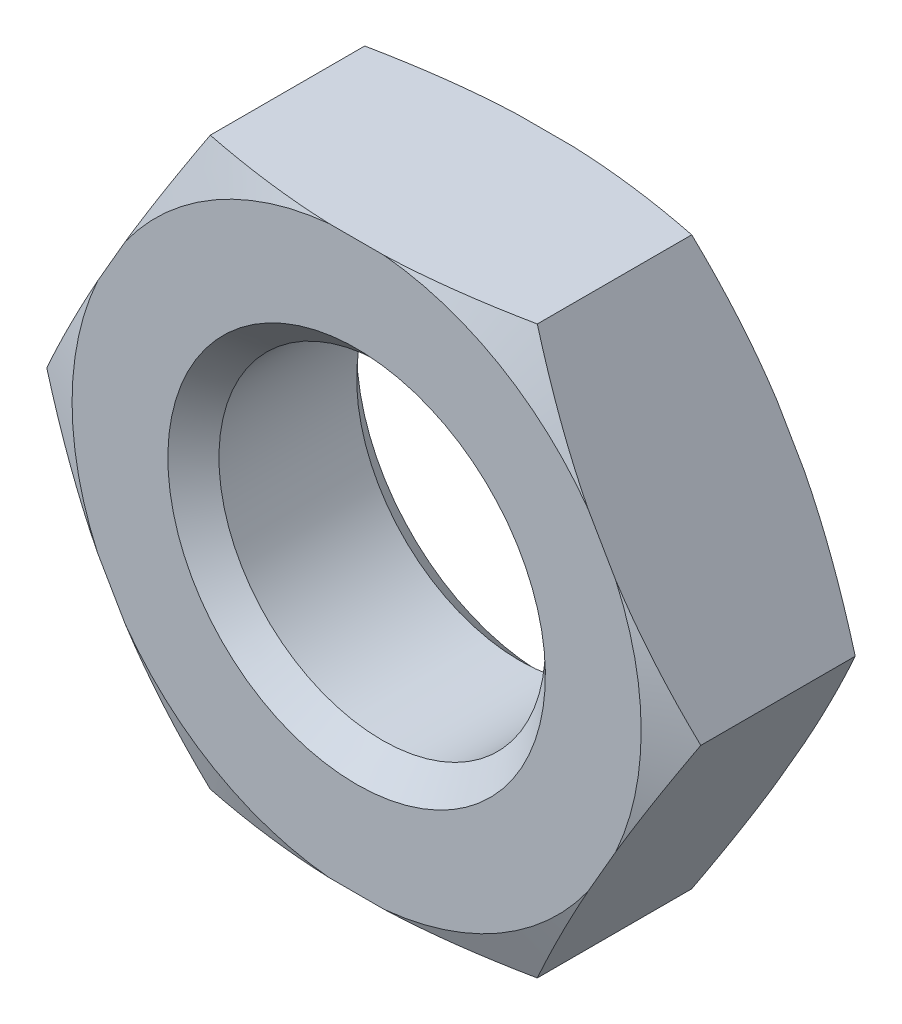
ISO-10303-21;
HEADER;
FILE_DESCRIPTION(('STEP AP214'),'2;1');
FILE_NAME('part.step','',(''),(''),'','','');
FILE_SCHEMA(('AUTOMOTIVE_DESIGN { 1 0 10303 214 1 1 1 1 }'));
ENDSEC;
DATA;
#1=APPLICATION_CONTEXT('core data for automotive mechanical design processes');
#2=APPLICATION_PROTOCOL_DEFINITION('international standard','automotive_design',2000,#1);
#3=PRODUCT_CONTEXT('',#1,'mechanical');
#4=PRODUCT('Part','Part','',(#3));
#5=PRODUCT_RELATED_PRODUCT_CATEGORY('part','',(#4));
#6=PRODUCT_DEFINITION_FORMATION('','',#4);
#7=PRODUCT_DEFINITION_CONTEXT('part definition',#1,'design');
#8=PRODUCT_DEFINITION('design','',#6,#7);
#9=PRODUCT_DEFINITION_SHAPE('','',#8);
#10=(LENGTH_UNIT() NAMED_UNIT(*) SI_UNIT(.MILLI.,.METRE.));
#11=(NAMED_UNIT(*) PLANE_ANGLE_UNIT() SI_UNIT($,.RADIAN.));
#12=(NAMED_UNIT(*) SI_UNIT($,.STERADIAN.) SOLID_ANGLE_UNIT());
#13=UNCERTAINTY_MEASURE_WITH_UNIT(LENGTH_MEASURE(1.E-05),#10,'distance_accuracy_value','');
#14=(GEOMETRIC_REPRESENTATION_CONTEXT(3) GLOBAL_UNCERTAINTY_ASSIGNED_CONTEXT((#13)) GLOBAL_UNIT_ASSIGNED_CONTEXT((#10,
#11,#12)) REPRESENTATION_CONTEXT('',''));
#15=CARTESIAN_POINT('',(0.,0.,0.));
#16=DIRECTION('',(0.,0.,1.));
#17=DIRECTION('',(1.,0.,0.));
#18=AXIS2_PLACEMENT_3D('',#15,#16,#17);
#19=CARTESIAN_POINT('',(0.,0.,-4.85742956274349E-10));
#20=DIRECTION('',(0.,0.,-1.));
#21=DIRECTION('',(0.,1.,0.));
#22=AXIS2_PLACEMENT_3D('',#19,#20,#21);
#23=CONICAL_SURFACE('',#22,7.99999999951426,0.7853981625);
#24=CARTESIAN_POINT('',(0.,0.,-4.85743389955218E-10));
#25=DIRECTION('',(0.,0.,-1.));
#26=DIRECTION('',(0.,1.,0.));
#27=AXIS2_PLACEMENT_3D('',#24,#25,#26);
#28=CIRCLE('',#27,7.99999999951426);
#29=CARTESIAN_POINT('',(0.,7.99999999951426,-4.85743879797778E-10));
#30=VERTEX_POINT('',#29);
#31=EDGE_CURVE('E456',#30,#30,#28,.T.);
#32=ORIENTED_EDGE('',*,*,#31,.T.);
#33=EDGE_LOOP('',(#32));
#34=FACE_BOUND('',#33,.T.);
#35=CARTESIAN_POINT('',(0.,0.,1.0825));
#36=DIRECTION('',(0.,0.,1.));
#37=DIRECTION('',(0.,-1.,0.));
#38=AXIS2_PLACEMENT_3D('',#35,#36,#37);
#39=CIRCLE('',#38,6.9175);
#40=CARTESIAN_POINT('',(0.,-6.9175,1.0825));
#41=VERTEX_POINT('',#40);
#42=EDGE_CURVE('E235',#41,#41,#39,.T.);
#43=ORIENTED_EDGE('',*,*,#42,.T.);
#44=EDGE_LOOP('',(#43));
#45=FACE_BOUND('',#44,.T.);
#46=ADVANCED_FACE('F16',(#34,#45),#23,.F.);
#47=CARTESIAN_POINT('',(0.,0.,0.731636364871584));
#48=DIRECTION('',(0.,0.,1.));
#49=DIRECTION('',(0.,-1.,0.));
#50=AXIS2_PLACEMENT_3D('',#47,#48,#49);
#51=CONICAL_SURFACE('',#50,13.8708003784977,1.18682389);
#52=CARTESIAN_POINT('',(0.,0.,-1.22057333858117E-09));
#53=DIRECTION('',(0.,0.,1.));
#54=DIRECTION('',(0.,-1.,0.));
#55=AXIS2_PLACEMENT_3D('',#52,#53,#54);
#56=CIRCLE('',#55,12.0599368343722);
#57=CARTESIAN_POINT('',(1.16934872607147,-12.0031120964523,-1.31910535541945E-09));
#58=VERTEX_POINT('',#57);
#59=CARTESIAN_POINT('',(9.81032562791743,-7.01424176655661,-6.10286266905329E-10));
#60=VERTEX_POINT('',#59);
#61=EDGE_CURVE('E20',#58,#60,#56,.T.);
#62=ORIENTED_EDGE('',*,*,#61,.T.);
#63=CARTESIAN_POINT('',(6.93000000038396,-12.0031120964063,0.727272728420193));
#64=CARTESIAN_POINT('',(7.1675119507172,-11.5917293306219,0.631302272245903));
#65=CARTESIAN_POINT('',(7.40580477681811,-11.1789940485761,0.542426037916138));
#66=CARTESIAN_POINT('',(7.88341272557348,-10.3517528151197,0.381660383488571));
#67=CARTESIAN_POINT('',(8.1227255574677,-9.937250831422,0.309743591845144));
#68=CARTESIAN_POINT('',(8.48268366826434,-9.31378509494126,0.216448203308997));
#69=CARTESIAN_POINT('',(8.6028581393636,-9.10563680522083,0.187775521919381));
#70=CARTESIAN_POINT('',(8.84348750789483,-8.68885451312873,0.135597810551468));
#71=CARTESIAN_POINT('',(8.96394240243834,-8.48022051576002,0.112092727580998));
#72=CARTESIAN_POINT('',(9.20528226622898,-8.06220760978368,0.0704915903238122));
#73=CARTESIAN_POINT('',(9.32616761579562,-7.85282804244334,0.0524043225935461));
#74=CARTESIAN_POINT('',(9.56812380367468,-7.43374763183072,0.0218980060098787));
#75=CARTESIAN_POINT('',(9.68919465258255,-7.2240467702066,0.00947929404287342));
#76=CARTESIAN_POINT('',(9.81032563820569,-7.01424174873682,-1.41636997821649E-09));
#77=B_SPLINE_CURVE_WITH_KNOTS('',3,(#63,#64,#65,#66,#67,#68,#69,#70,#71,#72,#73,#74,#75,#76),
.UNSPECIFIED.,.F.,.F.,(4,2,2,2,2,2,4),(0.,1.45401321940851,2.9056634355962,3.63177290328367,
4.35787492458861,5.08514823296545,5.81246475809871),.UNSPECIFIED.);
#78=CARTESIAN_POINT('',(6.92999999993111,-12.003112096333,0.727272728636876));
#79=VERTEX_POINT('',#78);
#80=EDGE_CURVE('E155',#79,#60,#77,.T.);
#81=ORIENTED_EDGE('',*,*,#80,.F.);
#82=CARTESIAN_POINT('',(1.16934872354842,-12.0031120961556,-1.21721044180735E-09));
#83=CARTESIAN_POINT('',(1.4116106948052,-12.0031120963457,0.00947929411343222));
#84=CARTESIAN_POINT('',(1.65375239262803,-12.0031120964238,0.0218980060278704));
#85=CARTESIAN_POINT('',(2.13766476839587,-12.0031120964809,0.052404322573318));
#86=CARTESIAN_POINT('',(2.37943546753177,-12.00311209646,0.0704915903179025));
#87=CARTESIAN_POINT('',(2.86211519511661,-12.0031120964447,0.112092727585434));
#88=CARTESIAN_POINT('',(3.10302498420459,-12.0031120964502,0.135597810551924));
#89=CARTESIAN_POINT('',(3.58428372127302,-12.0031120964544,0.187775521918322));
#90=CARTESIAN_POINT('',(3.82463266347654,-12.0031120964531,0.216448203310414));
#91=CARTESIAN_POINT('',(4.54454888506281,-12.0031120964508,0.309743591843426));
#92=CARTESIAN_POINT('',(5.02317454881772,-12.0031120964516,0.381660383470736));
#93=CARTESIAN_POINT('',(5.9783904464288,-12.0031120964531,0.542426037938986));
#94=CARTESIAN_POINT('',(6.4549760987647,-12.0031120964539,0.63130227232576));
#95=CARTESIAN_POINT('',(6.92999999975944,-12.0031120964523,0.727272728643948));
#96=B_SPLINE_CURVE_WITH_KNOTS('',3,(#82,#83,#84,#85,#86,#87,#88,#89,#90,#91,#92,#93,#94,#95),
.UNSPECIFIED.,.F.,.F.,(4,2,2,2,2,2,4),(0.,0.727316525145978,1.45458983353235,2.180691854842,
2.90680132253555,4.35845153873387,5.8124647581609),.UNSPECIFIED.);
#97=EDGE_CURVE('E153',#58,#79,#96,.T.);
#98=ORIENTED_EDGE('',*,*,#97,.F.);
#99=EDGE_LOOP('',(#62,#81,#98));
#100=FACE_BOUND('',#99,.T.);
#101=ADVANCED_FACE('F154',(#100),#51,.T.);
#102=CARTESIAN_POINT('',(0.,0.,0.731636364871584));
#103=DIRECTION('',(0.,0.,1.));
#104=DIRECTION('',(0.,-1.,0.));
#105=AXIS2_PLACEMENT_3D('',#102,#103,#104);
#106=CONICAL_SURFACE('',#105,13.8708003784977,1.18682389);
#107=CARTESIAN_POINT('',(0.,0.,-1.22057192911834E-09));
#108=DIRECTION('',(0.,0.,1.));
#109=DIRECTION('',(0.,-1.,0.));
#110=AXIS2_PLACEMENT_3D('',#107,#108,#109);
#111=CIRCLE('',#110,12.0599368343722);
#112=CARTESIAN_POINT('',(10.9796743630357,-4.98887034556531,-1.31910585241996E-09));
#113=VERTEX_POINT('',#112);
#114=CARTESIAN_POINT('',(10.9796743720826,4.98887032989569,-6.10286304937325E-10));
#115=VERTEX_POINT('',#114);
#116=EDGE_CURVE('E152',#113,#115,#111,.T.);
#117=ORIENTED_EDGE('',*,*,#116,.T.);
#118=CARTESIAN_POINT('',(13.8600000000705,3.22593119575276E-10,0.727272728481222));
#119=CARTESIAN_POINT('',(13.6224880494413,0.411382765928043,0.631302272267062));
#120=CARTESIAN_POINT('',(13.3841952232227,0.824118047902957,0.542426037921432));
#121=CARTESIAN_POINT('',(12.9065872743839,1.6513592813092,0.381660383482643));
#122=CARTESIAN_POINT('',(12.6672744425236,2.06586126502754,0.309743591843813));
#123=CARTESIAN_POINT('',(12.3073163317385,2.68932700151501,0.216448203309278));
#124=CARTESIAN_POINT('',(12.1871418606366,2.89747529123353,0.18777552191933));
#125=CARTESIAN_POINT('',(11.9465124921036,3.31425758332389,0.135597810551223));
#126=CARTESIAN_POINT('',(11.826057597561,3.52289158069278,0.112092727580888));
#127=CARTESIAN_POINT('',(11.5847177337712,3.94090448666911,0.0704915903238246));
#128=CARTESIAN_POINT('',(11.4638323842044,4.15028405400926,0.0524043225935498));
#129=CARTESIAN_POINT('',(11.2218761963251,4.56936446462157,0.0218980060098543));
#130=CARTESIAN_POINT('',(11.1008053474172,4.77906532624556,0.00947929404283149));
#131=CARTESIAN_POINT('',(10.9796743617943,4.98887034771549,-1.41637149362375E-09));
#132=B_SPLINE_CURVE_WITH_KNOTS('',3,(#118,#119,#120,#121,#122,#123,#124,#125,#126,#127,#128,
#129,#130,#131),.UNSPECIFIED.,.F.,.F.,(4,2,2,2,2,2,4),(0.,1.45401321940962,2.90566343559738,
3.63177290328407,4.35787492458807,5.08514823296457,5.8124647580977),.UNSPECIFIED.);
#133=CARTESIAN_POINT('',(13.8599999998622,0.,0.727272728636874));
#134=VERTEX_POINT('',#133);
#135=EDGE_CURVE('E177',#134,#115,#132,.T.);
#136=ORIENTED_EDGE('',*,*,#135,.F.);
#137=CARTESIAN_POINT('',(10.9796743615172,-4.98887034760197,-1.2172112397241E-09));
#138=CARTESIAN_POINT('',(11.1008053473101,-4.77906532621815,0.00947929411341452));
#139=CARTESIAN_POINT('',(11.2218761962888,-4.56936446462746,0.0218980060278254));
#140=CARTESIAN_POINT('',(11.4638323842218,-4.15028405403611,0.0524043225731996));
#141=CARTESIAN_POINT('',(11.5847177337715,-3.94090448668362,0.0704915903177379));
#142=CARTESIAN_POINT('',(11.8260575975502,-3.52289158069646,0.11209272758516));
#143=CARTESIAN_POINT('',(11.9465124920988,-3.31425758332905,0.135597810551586));
#144=CARTESIAN_POINT('',(12.1871418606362,-2.89747529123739,0.18777552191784));
#145=CARTESIAN_POINT('',(12.3073163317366,-2.6893270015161,0.216448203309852));
#146=CARTESIAN_POINT('',(12.6672744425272,-2.06586126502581,0.3097435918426));
#147=CARTESIAN_POINT('',(12.9065872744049,-1.65135928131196,0.381660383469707));
#148=CARTESIAN_POINT('',(13.3841952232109,-0.824118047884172,0.542426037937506));
#149=CARTESIAN_POINT('',(13.6224880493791,-0.411382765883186,0.631302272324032));
#150=CARTESIAN_POINT('',(13.8599999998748,-2.16880930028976E-10,0.727272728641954));
#151=B_SPLINE_CURVE_WITH_KNOTS('',3,(#137,#138,#139,#140,#141,#142,#143,#144,#145,#146,#147,
#148,#149,#150),.UNSPECIFIED.,.F.,.F.,(4,2,2,2,2,2,4),(0.,0.727316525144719,1.45458983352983,
2.18069185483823,2.90680132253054,4.35845153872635,5.81246475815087),.UNSPECIFIED.);
#152=EDGE_CURVE('E169',#113,#134,#151,.T.);
#153=ORIENTED_EDGE('',*,*,#152,.F.);
#154=EDGE_LOOP('',(#117,#136,#153));
#155=FACE_BOUND('',#154,.T.);
#156=ADVANCED_FACE('F332',(#155),#106,.T.);
#157=CARTESIAN_POINT('',(0.,0.,0.731636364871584));
#158=DIRECTION('',(0.,0.,1.));
#159=DIRECTION('',(0.,-1.,0.));
#160=AXIS2_PLACEMENT_3D('',#157,#158,#159);
#161=CONICAL_SURFACE('',#160,13.8708003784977,1.18682389);
#162=CARTESIAN_POINT('',(0.,0.,-1.22057192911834E-09));
#163=DIRECTION('',(0.,0.,1.));
#164=DIRECTION('',(0.,-1.,0.));
#165=AXIS2_PLACEMENT_3D('',#162,#163,#164);
#166=CIRCLE('',#165,12.0599368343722);
#167=CARTESIAN_POINT('',(9.81032563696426,7.01424175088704,-1.31910617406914E-09));
#168=VERTEX_POINT('',#167);
#169=CARTESIAN_POINT('',(1.16934874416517,12.0031120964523,-6.10286707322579E-10));
#170=VERTEX_POINT('',#169);
#171=EDGE_CURVE('E481',#168,#170,#166,.T.);
#172=ORIENTED_EDGE('',*,*,#171,.T.);
#173=CARTESIAN_POINT('',(6.9299999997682,12.0031120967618,0.727272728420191));
#174=CARTESIAN_POINT('',(6.45497609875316,12.0031120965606,0.631302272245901));
#175=CARTESIAN_POINT('',(5.9783904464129,12.0031120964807,0.542426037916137));
#176=CARTESIAN_POINT('',(5.02317454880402,12.003112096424,0.381660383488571));
#177=CARTESIAN_POINT('',(4.54454888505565,12.0031120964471,0.309743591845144));
#178=CARTESIAN_POINT('',(3.82463266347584,12.0031120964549,0.216448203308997));
#179=CARTESIAN_POINT('',(3.58428372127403,12.003112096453,0.18777552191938));
#180=CARTESIAN_POINT('',(3.10302498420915,12.0031120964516,0.135597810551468));
#181=CARTESIAN_POINT('',(2.86211519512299,12.0031120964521,0.112092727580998));
#182=CARTESIAN_POINT('',(2.37943546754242,12.0031120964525,0.0704915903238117));
#183=CARTESIAN_POINT('',(2.13766476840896,12.0031120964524,0.0524043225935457));
#184=CARTESIAN_POINT('',(1.65375239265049,12.0031120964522,0.0218980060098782));
#185=CARTESIAN_POINT('',(1.41161069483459,12.0031120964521,0.0094792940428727));
#186=CARTESIAN_POINT('',(1.16934872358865,12.0031120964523,-1.41637111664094E-09));
#187=B_SPLINE_CURVE_WITH_KNOTS('',3,(#173,#174,#175,#176,#177,#178,#179,#180,#181,#182,#183,
#184,#185,#186),.UNSPECIFIED.,.F.,.F.,(4,2,2,2,2,2,4),(0.,1.4540132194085,2.90566343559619,
3.63177290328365,4.35787492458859,5.08514823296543,5.81246475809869),.UNSPECIFIED.);
#188=CARTESIAN_POINT('',(6.9299999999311,12.003112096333,0.727272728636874));
#189=VERTEX_POINT('',#188);
#190=EDGE_CURVE('E186',#189,#170,#187,.T.);
#191=ORIENTED_EDGE('',*,*,#190,.F.);
#192=CARTESIAN_POINT('',(9.81032563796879,7.01424174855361,-1.21721230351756E-09));
#193=CARTESIAN_POINT('',(9.6891946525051,7.22404677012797,0.00947929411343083));
#194=CARTESIAN_POINT('',(9.56812380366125,7.43374763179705,0.0218980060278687));
#195=CARTESIAN_POINT('',(9.3261676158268,7.85282804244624,0.0524043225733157));
#196=CARTESIAN_POINT('',(9.20528226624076,8.0622076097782,0.0704915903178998));
#197=CARTESIAN_POINT('',(8.96394240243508,8.48022051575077,0.112092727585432));
#198=CARTESIAN_POINT('',(8.84348750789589,8.68885451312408,0.135597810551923));
#199=CARTESIAN_POINT('',(8.60285813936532,9.10563680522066,0.187775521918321));
#200=CARTESIAN_POINT('',(8.48268366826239,9.31378509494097,0.216448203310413));
#201=CARTESIAN_POINT('',(8.12272555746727,9.93725083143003,0.309743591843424));
#202=CARTESIAN_POINT('',(7.88341272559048,10.3517528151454,0.381660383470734));
#203=CARTESIAN_POINT('',(7.40580477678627,11.1789940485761,0.542426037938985));
#204=CARTESIAN_POINT('',(7.16751195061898,11.5917293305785,0.631302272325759));
#205=CARTESIAN_POINT('',(6.93000000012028,12.003112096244,0.727272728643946));
#206=B_SPLINE_CURVE_WITH_KNOTS('',3,(#192,#193,#194,#195,#196,#197,#198,#199,#200,#201,#202,
#203,#204,#205),.UNSPECIFIED.,.F.,.F.,(4,2,2,2,2,2,4),(0.,0.727316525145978,1.45458983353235,
2.180691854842,2.90680132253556,4.35845153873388,5.81246475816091),.UNSPECIFIED.);
#207=EDGE_CURVE('E176',#168,#189,#206,.T.);
#208=ORIENTED_EDGE('',*,*,#207,.F.);
#209=EDGE_LOOP('',(#172,#191,#208));
#210=FACE_BOUND('',#209,.T.);
#211=ADVANCED_FACE('F336',(#210),#161,.T.);
#212=CARTESIAN_POINT('',(0.,0.,0.731636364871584));
#213=DIRECTION('',(0.,0.,1.));
#214=DIRECTION('',(0.,-1.,0.));
#215=AXIS2_PLACEMENT_3D('',#212,#213,#214);
#216=CONICAL_SURFACE('',#215,13.8708003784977,1.18682389);
#217=CARTESIAN_POINT('',(-1.16934872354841,12.0031120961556,-1.21721270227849E-09));
#218=CARTESIAN_POINT('',(-1.41161069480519,12.0031120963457,0.00947929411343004));
#219=CARTESIAN_POINT('',(-1.65375239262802,12.0031120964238,0.0218980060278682));
#220=CARTESIAN_POINT('',(-2.13766476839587,12.0031120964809,0.0524043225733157));
#221=CARTESIAN_POINT('',(-2.37943546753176,12.00311209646,0.0704915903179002));
#222=CARTESIAN_POINT('',(-2.8621151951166,12.0031120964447,0.112092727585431));
#223=CARTESIAN_POINT('',(-3.10302498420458,12.0031120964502,0.135597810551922));
#224=CARTESIAN_POINT('',(-3.58428372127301,12.0031120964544,0.18777552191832));
#225=CARTESIAN_POINT('',(-3.82463266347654,12.0031120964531,0.216448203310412));
#226=CARTESIAN_POINT('',(-4.5445488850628,12.0031120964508,0.309743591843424));
#227=CARTESIAN_POINT('',(-5.02317454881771,12.0031120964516,0.381660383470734));
#228=CARTESIAN_POINT('',(-5.97839044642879,12.0031120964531,0.542426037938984));
#229=CARTESIAN_POINT('',(-6.45497609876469,12.0031120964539,0.631302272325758));
#230=CARTESIAN_POINT('',(-6.92999999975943,12.0031120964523,0.727272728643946));
#231=B_SPLINE_CURVE_WITH_KNOTS('',3,(#217,#218,#219,#220,#221,#222,#223,#224,#225,#226,#227,
#228,#229,#230),.UNSPECIFIED.,.F.,.F.,(4,2,2,2,2,2,4),(0.,0.727316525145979,1.45458983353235,
2.180691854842,2.90680132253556,4.35845153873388,5.81246475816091),.UNSPECIFIED.);
#232=CARTESIAN_POINT('',(-1.16934872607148,12.0031120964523,-1.31910617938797E-09));
#233=VERTEX_POINT('',#232);
#234=CARTESIAN_POINT('',(-6.92999999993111,12.003112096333,0.727272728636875));
#235=VERTEX_POINT('',#234);
#236=EDGE_CURVE('E185',#233,#235,#231,.T.);
#237=ORIENTED_EDGE('',*,*,#236,.F.);
#238=CARTESIAN_POINT('',(0.,0.,-1.22057192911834E-09));
#239=DIRECTION('',(0.,0.,1.));
#240=DIRECTION('',(0.,-1.,0.));
#241=AXIS2_PLACEMENT_3D('',#238,#239,#240);
#242=CIRCLE('',#241,12.0599368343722);
#243=CARTESIAN_POINT('',(-9.81032563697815,7.01424175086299,-6.10286366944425E-10));
#244=VERTEX_POINT('',#243);
#245=EDGE_CURVE('E479',#233,#244,#242,.T.);
#246=ORIENTED_EDGE('',*,*,#245,.T.);
#247=CARTESIAN_POINT('',(-6.93000000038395,12.0031120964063,0.727272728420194));
#248=CARTESIAN_POINT('',(-7.1675119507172,11.5917293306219,0.631302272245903));
#249=CARTESIAN_POINT('',(-7.4058047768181,11.1789940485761,0.542426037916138));
#250=CARTESIAN_POINT('',(-7.88341272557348,10.3517528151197,0.381660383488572));
#251=CARTESIAN_POINT('',(-8.12272555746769,9.93725083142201,0.309743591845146));
#252=CARTESIAN_POINT('',(-8.48268366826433,9.31378509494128,0.216448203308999));
#253=CARTESIAN_POINT('',(-8.60285813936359,9.10563680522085,0.187775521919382));
#254=CARTESIAN_POINT('',(-8.84348750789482,8.68885451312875,0.135597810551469));
#255=CARTESIAN_POINT('',(-8.96394240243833,8.48022051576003,0.112092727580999));
#256=CARTESIAN_POINT('',(-9.20528226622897,8.0622076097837,0.0704915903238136));
#257=CARTESIAN_POINT('',(-9.32616761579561,7.85282804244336,0.0524043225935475));
#258=CARTESIAN_POINT('',(-9.56812380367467,7.43374763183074,0.0218980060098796));
#259=CARTESIAN_POINT('',(-9.68919465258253,7.22404677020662,0.0094792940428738));
#260=CARTESIAN_POINT('',(-9.81032563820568,7.01424174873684,-1.41637036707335E-09));
#261=B_SPLINE_CURVE_WITH_KNOTS('',3,(#247,#248,#249,#250,#251,#252,#253,#254,#255,#256,#257,
#258,#259,#260),.UNSPECIFIED.,.F.,.F.,(4,2,2,2,2,2,4),(0.,1.4540132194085,2.90566343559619,
3.63177290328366,4.35787492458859,5.08514823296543,5.81246475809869),.UNSPECIFIED.);
#262=EDGE_CURVE('E195',#235,#244,#261,.T.);
#263=ORIENTED_EDGE('',*,*,#262,.F.);
#264=EDGE_LOOP('',(#237,#246,#263));
#265=FACE_BOUND('',#264,.T.);
#266=ADVANCED_FACE('F401',(#265),#216,.T.);
#267=CARTESIAN_POINT('',(0.,0.,0.731636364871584));
#268=DIRECTION('',(0.,0.,1.));
#269=DIRECTION('',(0.,-1.,0.));
#270=AXIS2_PLACEMENT_3D('',#267,#268,#269);
#271=CONICAL_SURFACE('',#270,13.8708003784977,1.18682389);
#272=CARTESIAN_POINT('',(0.,0.,-1.22057192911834E-09));
#273=DIRECTION('',(0.,0.,1.));
#274=DIRECTION('',(0.,-1.,0.));
#275=AXIS2_PLACEMENT_3D('',#272,#273,#274);
#276=CIRCLE('',#275,12.0599368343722);
#277=CARTESIAN_POINT('',(-10.9796743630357,4.98887034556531,-1.31910629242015E-09));
#278=VERTEX_POINT('',#277);
#279=CARTESIAN_POINT('',(-10.9796743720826,-4.98887032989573,-6.10285624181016E-10));
#280=VERTEX_POINT('',#279);
#281=EDGE_CURVE('E454',#278,#280,#276,.T.);
#282=ORIENTED_EDGE('',*,*,#281,.T.);
#283=CARTESIAN_POINT('',(-13.8600000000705,-3.22594620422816E-10,0.727272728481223));
#284=CARTESIAN_POINT('',(-13.6224880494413,-0.411382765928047,0.631302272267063));
#285=CARTESIAN_POINT('',(-13.3841952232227,-0.824118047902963,0.542426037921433));
#286=CARTESIAN_POINT('',(-12.9065872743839,-1.6513592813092,0.381660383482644));
#287=CARTESIAN_POINT('',(-12.6672744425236,-2.06586126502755,0.309743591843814));
#288=CARTESIAN_POINT('',(-12.3073163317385,-2.68932700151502,0.216448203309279));
#289=CARTESIAN_POINT('',(-12.1871418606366,-2.89747529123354,0.187775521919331));
#290=CARTESIAN_POINT('',(-11.9465124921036,-3.31425758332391,0.135597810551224));
#291=CARTESIAN_POINT('',(-11.826057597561,-3.5228915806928,0.112092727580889));
#292=CARTESIAN_POINT('',(-11.5847177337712,-3.94090448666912,0.0704915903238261));
#293=CARTESIAN_POINT('',(-11.4638323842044,-4.15028405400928,0.0524043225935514));
#294=CARTESIAN_POINT('',(-11.2218761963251,-4.56936446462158,0.0218980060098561));
#295=CARTESIAN_POINT('',(-11.1008053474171,-4.77906532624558,0.00947929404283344));
#296=CARTESIAN_POINT('',(-10.9796743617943,-4.9888703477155,-1.41636918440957E-09));
#297=B_SPLINE_CURVE_WITH_KNOTS('',3,(#283,#284,#285,#286,#287,#288,#289,#290,#291,#292,#293,
#294,#295,#296),.UNSPECIFIED.,.F.,.F.,(4,2,2,2,2,2,4),(0.,1.45401321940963,2.90566343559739,
3.63177290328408,4.35787492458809,5.08514823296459,5.81246475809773),.UNSPECIFIED.);
#298=CARTESIAN_POINT('',(-13.8599999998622,0.,0.727272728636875));
#299=VERTEX_POINT('',#298);
#300=EDGE_CURVE('E208',#299,#280,#297,.T.);
#301=ORIENTED_EDGE('',*,*,#300,.F.);
#302=CARTESIAN_POINT('',(-10.9796743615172,4.98887034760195,-1.21721097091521E-09));
#303=CARTESIAN_POINT('',(-11.1008053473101,4.77906532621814,0.00947929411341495));
#304=CARTESIAN_POINT('',(-11.2218761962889,4.56936446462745,0.0218980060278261));
#305=CARTESIAN_POINT('',(-11.4638323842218,4.1502840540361,0.0524043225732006));
#306=CARTESIAN_POINT('',(-11.5847177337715,3.94090448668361,0.0704915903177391));
#307=CARTESIAN_POINT('',(-11.8260575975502,3.52289158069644,0.112092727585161));
#308=CARTESIAN_POINT('',(-11.9465124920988,3.31425758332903,0.135597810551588));
#309=CARTESIAN_POINT('',(-12.1871418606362,2.89747529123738,0.187775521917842));
#310=CARTESIAN_POINT('',(-12.3073163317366,2.68932700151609,0.216448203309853));
#311=CARTESIAN_POINT('',(-12.6672744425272,2.0658612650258,0.309743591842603));
#312=CARTESIAN_POINT('',(-12.9065872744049,1.65135928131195,0.381660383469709));
#313=CARTESIAN_POINT('',(-13.3841952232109,0.824118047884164,0.542426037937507));
#314=CARTESIAN_POINT('',(-13.6224880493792,0.41138276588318,0.631302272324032));
#315=CARTESIAN_POINT('',(-13.8599999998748,2.16876274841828E-10,0.727272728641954));
#316=B_SPLINE_CURVE_WITH_KNOTS('',3,(#302,#303,#304,#305,#306,#307,#308,#309,#310,#311,#312,
#313,#314,#315),.UNSPECIFIED.,.F.,.F.,(4,2,2,2,2,2,4),(0.,0.727316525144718,1.45458983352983,
2.18069185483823,2.90680132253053,4.35845153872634,5.81246475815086),.UNSPECIFIED.);
#317=EDGE_CURVE('E194',#278,#299,#316,.T.);
#318=ORIENTED_EDGE('',*,*,#317,.F.);
#319=EDGE_LOOP('',(#282,#301,#318));
#320=FACE_BOUND('',#319,.T.);
#321=ADVANCED_FACE('F404',(#320),#271,.T.);
#322=CARTESIAN_POINT('',(0.,0.,0.));
#323=DIRECTION('',(0.,0.,1.));
#324=DIRECTION('',(1.,0.,0.));
#325=AXIS2_PLACEMENT_3D('',#322,#323,#324);
#326=PLANE('',#325);
#327=ORIENTED_EDGE('',*,*,#31,.F.);
#328=EDGE_LOOP('',(#327));
#329=FACE_BOUND('',#328,.T.);
#330=DIRECTION('',(0.5,-0.866025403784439,0.));
#331=VECTOR('',#330,1.);
#332=CARTESIAN_POINT('',(-6.93000000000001,-12.0031120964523,0.));
#333=LINE('',#332,#331);
#334=CARTESIAN_POINT('',(-9.81032563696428,-7.01424175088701,-1.31910474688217E-09));
#335=VERTEX_POINT('',#334);
#336=EDGE_CURVE('E205',#280,#335,#333,.T.);
#337=ORIENTED_EDGE('',*,*,#336,.F.);
#338=ORIENTED_EDGE('',*,*,#281,.F.);
#339=DIRECTION('',(-0.5,-0.866025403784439,0.));
#340=VECTOR('',#339,1.);
#341=CARTESIAN_POINT('',(-13.86,0.,0.));
#342=LINE('',#341,#340);
#343=EDGE_CURVE('E191',#244,#278,#342,.T.);
#344=ORIENTED_EDGE('',*,*,#343,.F.);
#345=ORIENTED_EDGE('',*,*,#245,.F.);
#346=DIRECTION('',(1.,0.,0.));
#347=VECTOR('',#346,1.);
#348=CARTESIAN_POINT('',(-6.93,12.0031120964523,0.));
#349=LINE('',#348,#347);
#350=EDGE_CURVE('E182',#170,#233,#349,.F.);
#351=ORIENTED_EDGE('',*,*,#350,.F.);
#352=ORIENTED_EDGE('',*,*,#171,.F.);
#353=DIRECTION('',(-0.5,0.866025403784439,0.));
#354=VECTOR('',#353,1.);
#355=CARTESIAN_POINT('',(6.93,12.0031120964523,0.));
#356=LINE('',#355,#354);
#357=EDGE_CURVE('E173',#115,#168,#356,.T.);
#358=ORIENTED_EDGE('',*,*,#357,.F.);
#359=ORIENTED_EDGE('',*,*,#116,.F.);
#360=DIRECTION('',(0.5,0.866025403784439,0.));
#361=VECTOR('',#360,1.);
#362=CARTESIAN_POINT('',(13.86,0.,0.));
#363=LINE('',#362,#361);
#364=EDGE_CURVE('E148',#60,#113,#363,.T.);
#365=ORIENTED_EDGE('',*,*,#364,.F.);
#366=ORIENTED_EDGE('',*,*,#61,.F.);
#367=DIRECTION('',(1.,0.,0.));
#368=VECTOR('',#367,1.);
#369=CARTESIAN_POINT('',(6.93,-12.0031120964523,0.));
#370=LINE('',#369,#368);
#371=CARTESIAN_POINT('',(-1.16934872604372,-12.0031120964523,-6.10285221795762E-10));
#372=VERTEX_POINT('',#371);
#373=EDGE_CURVE('E145',#372,#58,#370,.T.);
#374=ORIENTED_EDGE('',*,*,#373,.F.);
#375=CARTESIAN_POINT('',(0.,0.,-1.22057192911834E-09));
#376=DIRECTION('',(0.,0.,1.));
#377=DIRECTION('',(0.,-1.,0.));
#378=AXIS2_PLACEMENT_3D('',#375,#376,#377);
#379=CIRCLE('',#378,12.0599368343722);
#380=EDGE_CURVE('E237',#335,#372,#379,.T.);
#381=ORIENTED_EDGE('',*,*,#380,.F.);
#382=EDGE_LOOP('',(#337,#338,#344,#345,#351,#352,#358,#359,#365,#366,#374,#381));
#383=FACE_BOUND('',#382,.T.);
#384=ADVANCED_FACE('F143',(#329,#383),#326,.F.);
#385=CARTESIAN_POINT('',(0.,0.,0.731636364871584));
#386=DIRECTION('',(0.,0.,1.));
#387=DIRECTION('',(0.,-1.,0.));
#388=AXIS2_PLACEMENT_3D('',#385,#386,#387);
#389=CONICAL_SURFACE('',#388,13.8708003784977,1.18682389);
#390=CARTESIAN_POINT('',(-9.81032563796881,-7.01424174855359,-1.2172104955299E-09));
#391=CARTESIAN_POINT('',(-9.68919465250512,-7.22404677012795,0.00947929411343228));
#392=CARTESIAN_POINT('',(-9.56812380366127,-7.43374763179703,0.0218980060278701));
#393=CARTESIAN_POINT('',(-9.32616761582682,-7.85282804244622,0.0524043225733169));
#394=CARTESIAN_POINT('',(-9.20528226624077,-8.06220760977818,0.0704915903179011));
#395=CARTESIAN_POINT('',(-8.96394240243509,-8.48022051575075,0.112092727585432));
#396=CARTESIAN_POINT('',(-8.8434875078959,-8.68885451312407,0.135597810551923));
#397=CARTESIAN_POINT('',(-8.60285813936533,-9.10563680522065,0.187775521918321));
#398=CARTESIAN_POINT('',(-8.48268366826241,-9.31378509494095,0.216448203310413));
#399=CARTESIAN_POINT('',(-8.12272555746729,-9.93725083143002,0.309743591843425));
#400=CARTESIAN_POINT('',(-7.8834127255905,-10.3517528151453,0.381660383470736));
#401=CARTESIAN_POINT('',(-7.40580477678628,-11.1789940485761,0.542426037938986));
#402=CARTESIAN_POINT('',(-7.16751195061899,-11.5917293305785,0.631302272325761));
#403=CARTESIAN_POINT('',(-6.93000000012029,-12.003112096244,0.727272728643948));
#404=B_SPLINE_CURVE_WITH_KNOTS('',3,(#390,#391,#392,#393,#394,#395,#396,#397,#398,#399,#400,
#401,#402,#403),.UNSPECIFIED.,.F.,.F.,(4,2,2,2,2,2,4),(0.,0.727316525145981,1.45458983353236,
2.18069185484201,2.90680132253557,4.3584515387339,5.81246475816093),.UNSPECIFIED.);
#405=CARTESIAN_POINT('',(-6.92999999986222,-12.0031120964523,0.727272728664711));
#406=VERTEX_POINT('',#405);
#407=EDGE_CURVE('E204',#335,#406,#404,.T.);
#408=ORIENTED_EDGE('',*,*,#407,.F.);
#409=ORIENTED_EDGE('',*,*,#380,.T.);
#410=CARTESIAN_POINT('',(-6.9299999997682,-12.0031120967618,0.727272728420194));
#411=CARTESIAN_POINT('',(-6.45497609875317,-12.0031120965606,0.631302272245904));
#412=CARTESIAN_POINT('',(-5.97839044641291,-12.0031120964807,0.54242603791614));
#413=CARTESIAN_POINT('',(-5.02317454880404,-12.003112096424,0.381660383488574));
#414=CARTESIAN_POINT('',(-4.54454888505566,-12.0031120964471,0.309743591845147));
#415=CARTESIAN_POINT('',(-3.82463266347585,-12.0031120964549,0.216448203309));
#416=CARTESIAN_POINT('',(-3.58428372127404,-12.003112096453,0.187775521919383));
#417=CARTESIAN_POINT('',(-3.10302498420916,-12.0031120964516,0.135597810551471));
#418=CARTESIAN_POINT('',(-2.86211519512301,-12.0031120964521,0.112092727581));
#419=CARTESIAN_POINT('',(-2.37943546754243,-12.0031120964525,0.0704915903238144));
#420=CARTESIAN_POINT('',(-2.13766476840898,-12.0031120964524,0.0524043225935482));
#421=CARTESIAN_POINT('',(-1.6537523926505,-12.0031120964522,0.0218980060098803));
#422=CARTESIAN_POINT('',(-1.4116106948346,-12.0031120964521,0.00947929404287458));
#423=CARTESIAN_POINT('',(-1.16934872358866,-12.0031120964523,-1.41636957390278E-09));
#424=B_SPLINE_CURVE_WITH_KNOTS('',3,(#410,#411,#412,#413,#414,#415,#416,#417,#418,#419,#420,
#421,#422,#423),.UNSPECIFIED.,.F.,.F.,(4,2,2,2,2,2,4),(0.,1.4540132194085,2.90566343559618,
3.63177290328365,4.35787492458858,5.08514823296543,5.81246475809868),.UNSPECIFIED.);
#425=EDGE_CURVE('E163',#406,#372,#424,.T.);
#426=ORIENTED_EDGE('',*,*,#425,.F.);
#427=EDGE_LOOP('',(#408,#409,#426));
#428=FACE_BOUND('',#427,.T.);
#429=ADVANCED_FACE('F264',(#428),#389,.T.);
#430=CARTESIAN_POINT('',(0.,0.,4.));
#431=DIRECTION('',(0.,0.,1.));
#432=DIRECTION('',(0.,-1.,0.));
#433=AXIS2_PLACEMENT_3D('',#430,#431,#432);
#434=CYLINDRICAL_SURFACE('',#433,6.9175);
#435=ORIENTED_EDGE('',*,*,#42,.F.);
#436=EDGE_LOOP('',(#435));
#437=FACE_BOUND('',#436,.T.);
#438=CARTESIAN_POINT('',(0.,0.,6.91749999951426));
#439=DIRECTION('',(0.,0.,1.));
#440=DIRECTION('',(1.,0.,0.));
#441=AXIS2_PLACEMENT_3D('',#438,#439,#440);
#442=CIRCLE('',#441,6.91750000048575);
#443=CARTESIAN_POINT('',(6.91750000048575,0.,6.91749999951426));
#444=VERTEX_POINT('',#443);
#445=EDGE_CURVE('E203',#444,#444,#442,.T.);
#446=ORIENTED_EDGE('',*,*,#445,.T.);
#447=EDGE_LOOP('',(#446));
#448=FACE_BOUND('',#447,.T.);
#449=ADVANCED_FACE('F269',(#437,#448),#434,.F.);
#450=CARTESIAN_POINT('',(0.,0.,7.26836363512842));
#451=DIRECTION('',(0.,0.,-1.));
#452=DIRECTION('',(0.,1.,0.));
#453=AXIS2_PLACEMENT_3D('',#450,#451,#452);
#454=CONICAL_SURFACE('',#453,13.8708003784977,1.18682389);
#455=CARTESIAN_POINT('',(0.,0.,8.00000000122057));
#456=DIRECTION('',(0.,0.,-1.));
#457=DIRECTION('',(0.,1.,0.));
#458=AXIS2_PLACEMENT_3D('',#455,#456,#457);
#459=CIRCLE('',#458,12.0599368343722);
#460=CARTESIAN_POINT('',(-9.81032563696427,-7.01424175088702,8.00000000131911));
#461=VERTEX_POINT('',#460);
#462=CARTESIAN_POINT('',(-1.1693487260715,-12.0031120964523,8.00000000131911));
#463=VERTEX_POINT('',#462);
#464=EDGE_CURVE('E232',#461,#463,#459,.F.);
#465=ORIENTED_EDGE('',*,*,#464,.F.);
#466=CARTESIAN_POINT('',(-6.93000000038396,-12.0031120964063,7.27272727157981));
#467=CARTESIAN_POINT('',(-7.16751195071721,-11.5917293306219,7.3686977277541));
#468=CARTESIAN_POINT('',(-7.40580477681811,-11.1789940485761,7.45757396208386));
#469=CARTESIAN_POINT('',(-7.88341272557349,-10.3517528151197,7.61833961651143));
#470=CARTESIAN_POINT('',(-8.1227255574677,-9.937250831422,7.69025640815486));
#471=CARTESIAN_POINT('',(-8.48268366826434,-9.31378509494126,7.783551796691));
#472=CARTESIAN_POINT('',(-8.6028581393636,-9.10563680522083,7.81222447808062));
#473=CARTESIAN_POINT('',(-8.84348750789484,-8.68885451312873,7.86440218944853));
#474=CARTESIAN_POINT('',(-8.96394240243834,-8.48022051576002,7.887907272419));
#475=CARTESIAN_POINT('',(-9.20528226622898,-8.06220760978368,7.92950840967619));
#476=CARTESIAN_POINT('',(-9.32616761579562,-7.85282804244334,7.94759567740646));
#477=CARTESIAN_POINT('',(-9.56812380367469,-7.43374763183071,7.97810199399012));
#478=CARTESIAN_POINT('',(-9.68919465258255,-7.2240467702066,7.99052070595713));
#479=CARTESIAN_POINT('',(-9.8103256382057,-7.01424174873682,8.00000000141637));
#480=B_SPLINE_CURVE_WITH_KNOTS('',3,(#466,#467,#468,#469,#470,#471,#472,#473,#474,#475,#476,
#477,#478,#479),.UNSPECIFIED.,.F.,.F.,(4,2,2,2,2,2,4),(0.,1.45401321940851,2.9056634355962,
3.63177290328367,4.35787492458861,5.08514823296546,5.81246475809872),.UNSPECIFIED.);
#481=CARTESIAN_POINT('',(-6.92999999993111,-12.003112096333,7.27272727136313));
#482=VERTEX_POINT('',#481);
#483=EDGE_CURVE('E435',#482,#461,#480,.T.);
#484=ORIENTED_EDGE('',*,*,#483,.F.);
#485=CARTESIAN_POINT('',(-1.16934872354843,-12.0031120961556,8.00000000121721));
#486=CARTESIAN_POINT('',(-1.41161069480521,-12.0031120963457,7.99052070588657));
#487=CARTESIAN_POINT('',(-1.65375239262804,-12.0031120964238,7.97810199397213));
#488=CARTESIAN_POINT('',(-2.13766476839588,-12.0031120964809,7.94759567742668));
#489=CARTESIAN_POINT('',(-2.37943546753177,-12.00311209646,7.9295084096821));
#490=CARTESIAN_POINT('',(-2.86211519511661,-12.0031120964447,7.88790727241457));
#491=CARTESIAN_POINT('',(-3.10302498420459,-12.0031120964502,7.86440218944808));
#492=CARTESIAN_POINT('',(-3.58428372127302,-12.0031120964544,7.81222447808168));
#493=CARTESIAN_POINT('',(-3.82463266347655,-12.0031120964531,7.78355179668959));
#494=CARTESIAN_POINT('',(-4.54454888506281,-12.0031120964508,7.69025640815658));
#495=CARTESIAN_POINT('',(-5.02317454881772,-12.0031120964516,7.61833961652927));
#496=CARTESIAN_POINT('',(-5.9783904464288,-12.0031120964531,7.45757396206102));
#497=CARTESIAN_POINT('',(-6.45497609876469,-12.0031120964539,7.36869772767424));
#498=CARTESIAN_POINT('',(-6.92999999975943,-12.0031120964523,7.27272727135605));
#499=B_SPLINE_CURVE_WITH_KNOTS('',3,(#485,#486,#487,#488,#489,#490,#491,#492,#493,#494,#495,
#496,#497,#498),.UNSPECIFIED.,.F.,.F.,(4,2,2,2,2,2,4),(0.,0.727316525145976,1.45458983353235,
2.180691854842,2.90680132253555,4.35845153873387,5.81246475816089),.UNSPECIFIED.);
#500=EDGE_CURVE('E165',#463,#482,#499,.T.);
#501=ORIENTED_EDGE('',*,*,#500,.F.);
#502=EDGE_LOOP('',(#465,#484,#501));
#503=FACE_BOUND('',#502,.T.);
#504=ADVANCED_FACE('F291',(#503),#454,.T.);
#505=CARTESIAN_POINT('',(6.93,-12.0031120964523,0.));
#506=DIRECTION('',(0.,-1.,0.));
#507=DIRECTION('',(0.,0.,-1.));
#508=AXIS2_PLACEMENT_3D('',#505,#506,#507);
#509=PLANE('',#508);
#510=CARTESIAN_POINT('',(1.16934872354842,-12.0031120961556,8.00000000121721));
#511=CARTESIAN_POINT('',(1.41161069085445,-12.0031120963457,7.99052070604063));
#512=CARTESIAN_POINT('',(1.65375238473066,-12.0031120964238,7.9781019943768));
#513=CARTESIAN_POINT('',(2.13766475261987,-12.0031120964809,7.94759567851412));
#514=CARTESIAN_POINT('',(2.37943544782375,-12.00311209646,7.92950841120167));
#515=CARTESIAN_POINT('',(2.86211516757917,-12.0031120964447,7.88790727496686));
#516=CARTESIAN_POINT('',(3.10302495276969,-12.0031120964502,7.86440219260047));
#517=CARTESIAN_POINT('',(3.58428368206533,-12.0031120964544,7.81222448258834));
#518=CARTESIAN_POINT('',(3.82463262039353,-12.0031120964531,7.78355180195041));
#519=CARTESIAN_POINT('',(4.54454883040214,-12.0031120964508,7.69025641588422));
#520=CARTESIAN_POINT('',(5.02317448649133,-12.0031120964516,7.61833962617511));
#521=CARTESIAN_POINT('',(5.97839036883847,-12.0031120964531,7.45757397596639));
#522=CARTESIAN_POINT('',(6.45497601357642,-12.0031120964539,7.3686977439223));
#523=CARTESIAN_POINT('',(6.92999990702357,-12.0031120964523,7.27272729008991));
#524=B_SPLINE_CURVE_WITH_KNOTS('',3,(#510,#511,#512,#513,#514,#515,#516,#517,#518,#519,#520,
#521,#522,#523),.UNSPECIFIED.,.F.,.F.,(4,2,2,2,2,2,4),(0.,0.727316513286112,1.45458980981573,
2.18069181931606,2.90680127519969,4.35845146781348,5.81246466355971),.UNSPECIFIED.);
#525=CARTESIAN_POINT('',(1.16934872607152,-12.0031120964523,8.00000000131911));
#526=VERTEX_POINT('',#525);
#527=CARTESIAN_POINT('',(6.92999995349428,-12.0031120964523,7.27272728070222));
#528=VERTEX_POINT('',#527);
#529=EDGE_CURVE('E159',#526,#528,#524,.T.);
#530=ORIENTED_EDGE('',*,*,#529,.F.);
#531=DIRECTION('',(1.,0.,0.));
#532=VECTOR('',#531,1.);
#533=CARTESIAN_POINT('',(0.,-12.0031120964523,8.));
#534=LINE('',#533,#532);
#535=EDGE_CURVE('E229',#463,#526,#534,.T.);
#536=ORIENTED_EDGE('',*,*,#535,.F.);
#537=ORIENTED_EDGE('',*,*,#500,.T.);
#538=DIRECTION('',(0.,0.,1.));
#539=VECTOR('',#538,1.);
#540=CARTESIAN_POINT('',(-6.93000000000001,-12.0031120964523,0.));
#541=LINE('',#540,#539);
#542=EDGE_CURVE('E200',#406,#482,#541,.T.);
#543=ORIENTED_EDGE('',*,*,#542,.F.);
#544=ORIENTED_EDGE('',*,*,#425,.T.);
#545=ORIENTED_EDGE('',*,*,#373,.T.);
#546=ORIENTED_EDGE('',*,*,#97,.T.);
#547=DIRECTION('',(0.,0.,1.));
#548=VECTOR('',#547,1.);
#549=CARTESIAN_POINT('',(6.93000000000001,-12.0031120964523,0.));
#550=LINE('',#549,#548);
#551=EDGE_CURVE('E170',#528,#79,#550,.F.);
#552=ORIENTED_EDGE('',*,*,#551,.F.);
#553=EDGE_LOOP('',(#530,#536,#537,#543,#544,#545,#546,#552));
#554=FACE_BOUND('',#553,.T.);
#555=ADVANCED_FACE('F161',(#554),#509,.T.);
#556=CARTESIAN_POINT('',(0.,0.,7.26836363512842));
#557=DIRECTION('',(0.,0.,-1.));
#558=DIRECTION('',(0.,1.,0.));
#559=AXIS2_PLACEMENT_3D('',#556,#557,#558);
#560=CONICAL_SURFACE('',#559,13.8708003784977,1.18682389);
#561=CARTESIAN_POINT('',(9.8103256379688,-7.01424174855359,8.00000000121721));
#562=CARTESIAN_POINT('',(9.68919465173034,-7.2240467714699,7.99052070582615));
#563=CARTESIAN_POINT('',(9.56812380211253,-7.43374763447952,7.97810199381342));
#564=CARTESIAN_POINT('',(9.32616761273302,-7.85282804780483,7.94759567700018));
#565=CARTESIAN_POINT('',(9.20528226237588,-8.06220761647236,7.92950840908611));
#566=CARTESIAN_POINT('',(8.96394239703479,-8.48022052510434,7.88790727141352));
#567=CARTESIAN_POINT('',(8.84348750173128,-8.6888545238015,7.86440218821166));
#568=CARTESIAN_POINT('',(8.60285813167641,-9.10563681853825,7.8122244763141));
#569=CARTESIAN_POINT('',(8.4826836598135,-9.31378510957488,7.78355179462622));
#570=CARTESIAN_POINT('',(8.12272554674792,-9.93725084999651,7.69025640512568));
#571=CARTESIAN_POINT('',(7.88341271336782,-10.3517528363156,7.61833961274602));
#572=CARTESIAN_POINT('',(7.40580476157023,-11.178994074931,7.45757395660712));
#573=CARTESIAN_POINT('',(7.16751193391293,-11.5917293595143,7.36869772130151));
#574=CARTESIAN_POINT('',(6.92999998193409,-12.0031121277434,7.27272726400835));
#575=B_SPLINE_CURVE_WITH_KNOTS('',3,(#561,#562,#563,#564,#565,#566,#567,#568,#569,#570,#571,
#572,#573,#574),.UNSPECIFIED.,.F.,.F.,(4,2,2,2,2,2,4),(0.,0.727316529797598,1.45458984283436,
2.18069186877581,2.9068013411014,4.35845156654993,5.81246479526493),.UNSPECIFIED.);
#576=CARTESIAN_POINT('',(9.81032563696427,-7.01424175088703,8.00000000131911));
#577=VERTEX_POINT('',#576);
#578=EDGE_CURVE('E172',#577,#528,#575,.T.);
#579=ORIENTED_EDGE('',*,*,#578,.F.);
#580=CARTESIAN_POINT('',(0.,0.,8.00000000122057));
#581=DIRECTION('',(0.,0.,-1.));
#582=DIRECTION('',(0.,1.,0.));
#583=AXIS2_PLACEMENT_3D('',#580,#581,#582);
#584=CIRCLE('',#583,12.0599368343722);
#585=EDGE_CURVE('E228',#526,#577,#584,.F.);
#586=ORIENTED_EDGE('',*,*,#585,.F.);
#587=ORIENTED_EDGE('',*,*,#529,.T.);
#588=EDGE_LOOP('',(#579,#586,#587));
#589=FACE_BOUND('',#588,.T.);
#590=ADVANCED_FACE('F290',(#589),#560,.T.);
#591=CARTESIAN_POINT('',(13.86,0.,0.));
#592=DIRECTION('',(0.866025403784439,-0.5,0.));
#593=DIRECTION('',(0.5,0.866025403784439,0.));
#594=AXIS2_PLACEMENT_3D('',#591,#592,#593);
#595=PLANE('',#594);
#596=CARTESIAN_POINT('',(10.9796743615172,-4.98887034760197,8.00000000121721));
#597=CARTESIAN_POINT('',(11.1008053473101,-4.77906532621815,7.99052070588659));
#598=CARTESIAN_POINT('',(11.2218761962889,-4.56936446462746,7.97810199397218));
#599=CARTESIAN_POINT('',(11.4638323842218,-4.15028405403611,7.9475956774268));
#600=CARTESIAN_POINT('',(11.5847177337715,-3.94090448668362,7.92950840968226));
#601=CARTESIAN_POINT('',(11.8260575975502,-3.52289158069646,7.88790727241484));
#602=CARTESIAN_POINT('',(11.9465124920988,-3.31425758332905,7.86440218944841));
#603=CARTESIAN_POINT('',(12.1871418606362,-2.89747529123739,7.81222447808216));
#604=CARTESIAN_POINT('',(12.3073163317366,-2.6893270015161,7.78355179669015));
#605=CARTESIAN_POINT('',(12.6672744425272,-2.06586126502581,7.6902564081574));
#606=CARTESIAN_POINT('',(12.9065872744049,-1.65135928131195,7.61833961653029));
#607=CARTESIAN_POINT('',(13.3841952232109,-0.82411804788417,7.4575739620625));
#608=CARTESIAN_POINT('',(13.6224880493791,-0.411382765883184,7.36869772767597));
#609=CARTESIAN_POINT('',(13.8599999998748,-2.16879991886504E-10,7.27272727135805));
#610=B_SPLINE_CURVE_WITH_KNOTS('',3,(#596,#597,#598,#599,#600,#601,#602,#603,#604,#605,#606,
#607,#608,#609),.UNSPECIFIED.,.F.,.F.,(4,2,2,2,2,2,4),(0.,0.72731652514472,1.45458983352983,
2.18069185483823,2.90680132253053,4.35845153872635,5.81246475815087),.UNSPECIFIED.);
#611=CARTESIAN_POINT('',(10.9796743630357,-4.98887034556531,8.00000000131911));
#612=VERTEX_POINT('',#611);
#613=CARTESIAN_POINT('',(13.8599999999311,-1.19328593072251E-10,7.27272727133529));
#614=VERTEX_POINT('',#613);
#615=EDGE_CURVE('E323',#612,#614,#610,.T.);
#616=ORIENTED_EDGE('',*,*,#615,.F.);
#617=DIRECTION('',(0.5,0.866025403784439,0.));
#618=VECTOR('',#617,1.);
#619=CARTESIAN_POINT('',(9.81032563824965,-7.01424174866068,8.));
#620=LINE('',#619,#618);
#621=EDGE_CURVE('E225',#577,#612,#620,.T.);
#622=ORIENTED_EDGE('',*,*,#621,.F.);
#623=ORIENTED_EDGE('',*,*,#578,.T.);
#624=ORIENTED_EDGE('',*,*,#551,.T.);
#625=ORIENTED_EDGE('',*,*,#80,.T.);
#626=ORIENTED_EDGE('',*,*,#364,.T.);
#627=ORIENTED_EDGE('',*,*,#152,.T.);
#628=DIRECTION('',(0.,0.,1.));
#629=VECTOR('',#628,1.);
#630=CARTESIAN_POINT('',(13.86,0.,0.));
#631=LINE('',#630,#629);
#632=EDGE_CURVE('E178',#614,#134,#631,.F.);
#633=ORIENTED_EDGE('',*,*,#632,.F.);
#634=EDGE_LOOP('',(#616,#622,#623,#624,#625,#626,#627,#633));
#635=FACE_BOUND('',#634,.T.);
#636=ADVANCED_FACE('F311',(#635),#595,.T.);
#637=CARTESIAN_POINT('',(0.,0.,7.26836363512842));
#638=DIRECTION('',(0.,0.,-1.));
#639=DIRECTION('',(0.,1.,0.));
#640=AXIS2_PLACEMENT_3D('',#637,#638,#639);
#641=CONICAL_SURFACE('',#640,13.8708003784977,1.18682389);
#642=CARTESIAN_POINT('',(10.9796743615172,4.98887034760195,8.00000000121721));
#643=CARTESIAN_POINT('',(11.1008053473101,4.77906532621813,7.99052070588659));
#644=CARTESIAN_POINT('',(11.2218761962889,4.56936446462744,7.97810199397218));
#645=CARTESIAN_POINT('',(11.4638323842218,4.1502840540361,7.9475956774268));
#646=CARTESIAN_POINT('',(11.5847177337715,3.9409044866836,7.92950840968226));
#647=CARTESIAN_POINT('',(11.8260575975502,3.52289158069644,7.88790727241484));
#648=CARTESIAN_POINT('',(11.9465124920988,3.31425758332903,7.86440218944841));
#649=CARTESIAN_POINT('',(12.1871418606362,2.89747529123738,7.81222447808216));
#650=CARTESIAN_POINT('',(12.3073163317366,2.68932700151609,7.78355179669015));
#651=CARTESIAN_POINT('',(12.6672744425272,2.0658612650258,7.6902564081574));
#652=CARTESIAN_POINT('',(12.9065872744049,1.65135928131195,7.61833961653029));
#653=CARTESIAN_POINT('',(13.3841952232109,0.824118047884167,7.45757396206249));
#654=CARTESIAN_POINT('',(13.6224880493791,0.411382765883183,7.36869772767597));
#655=CARTESIAN_POINT('',(13.8599999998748,2.168785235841E-10,7.27272727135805));
#656=B_SPLINE_CURVE_WITH_KNOTS('',3,(#642,#643,#644,#645,#646,#647,#648,#649,#650,#651,#652,
#653,#654,#655),.UNSPECIFIED.,.F.,.F.,(4,2,2,2,2,2,4),(0.,0.727316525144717,1.45458983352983,
2.18069185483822,2.90680132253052,4.35845153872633,5.81246475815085),.UNSPECIFIED.);
#657=CARTESIAN_POINT('',(10.9796743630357,4.98887034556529,8.00000000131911));
#658=VERTEX_POINT('',#657);
#659=EDGE_CURVE('E181',#658,#614,#656,.T.);
#660=ORIENTED_EDGE('',*,*,#659,.F.);
#661=CARTESIAN_POINT('',(0.,0.,8.00000000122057));
#662=DIRECTION('',(0.,0.,-1.));
#663=DIRECTION('',(0.,1.,0.));
#664=AXIS2_PLACEMENT_3D('',#661,#662,#663);
#665=CIRCLE('',#664,12.0599368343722);
#666=EDGE_CURVE('E224',#612,#658,#665,.F.);
#667=ORIENTED_EDGE('',*,*,#666,.F.);
#668=ORIENTED_EDGE('',*,*,#615,.T.);
#669=EDGE_LOOP('',(#660,#667,#668));
#670=FACE_BOUND('',#669,.T.);
#671=ADVANCED_FACE('F315',(#670),#641,.T.);
#672=CARTESIAN_POINT('',(6.93,12.0031120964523,0.));
#673=DIRECTION('',(0.866025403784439,0.5,0.));
#674=DIRECTION('',(-0.5,0.866025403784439,0.));
#675=AXIS2_PLACEMENT_3D('',#672,#673,#674);
#676=PLANE('',#675);
#677=CARTESIAN_POINT('',(9.81032563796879,7.01424174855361,8.00000000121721));
#678=CARTESIAN_POINT('',(9.6891946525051,7.22404677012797,7.99052070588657));
#679=CARTESIAN_POINT('',(9.56812380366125,7.43374763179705,7.97810199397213));
#680=CARTESIAN_POINT('',(9.3261676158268,7.85282804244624,7.94759567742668));
#681=CARTESIAN_POINT('',(9.20528226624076,8.0622076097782,7.9295084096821));
#682=CARTESIAN_POINT('',(8.96394240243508,8.48022051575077,7.88790727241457));
#683=CARTESIAN_POINT('',(8.84348750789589,8.68885451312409,7.86440218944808));
#684=CARTESIAN_POINT('',(8.60285813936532,9.10563680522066,7.81222447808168));
#685=CARTESIAN_POINT('',(8.48268366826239,9.31378509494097,7.78355179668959));
#686=CARTESIAN_POINT('',(8.12272555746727,9.93725083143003,7.69025640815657));
#687=CARTESIAN_POINT('',(7.88341272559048,10.3517528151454,7.61833961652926));
#688=CARTESIAN_POINT('',(7.40580477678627,11.1789940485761,7.45757396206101));
#689=CARTESIAN_POINT('',(7.16751195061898,11.5917293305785,7.36869772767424));
#690=CARTESIAN_POINT('',(6.93000000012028,12.003112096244,7.27272727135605));
#691=B_SPLINE_CURVE_WITH_KNOTS('',3,(#677,#678,#679,#680,#681,#682,#683,#684,#685,#686,#687,
#688,#689,#690),.UNSPECIFIED.,.F.,.F.,(4,2,2,2,2,2,4),(0.,0.727316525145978,1.45458983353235,
2.180691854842,2.90680132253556,4.35845153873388,5.81246475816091),.UNSPECIFIED.);
#692=CARTESIAN_POINT('',(9.81032563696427,7.01424175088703,8.00000000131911));
#693=VERTEX_POINT('',#692);
#694=CARTESIAN_POINT('',(6.93000000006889,12.003112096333,7.27272727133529));
#695=VERTEX_POINT('',#694);
#696=EDGE_CURVE('E367',#693,#695,#691,.T.);
#697=ORIENTED_EDGE('',*,*,#696,.F.);
#698=DIRECTION('',(-0.5,0.866025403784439,0.));
#699=VECTOR('',#698,1.);
#700=CARTESIAN_POINT('',(10.9796743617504,4.98887034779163,8.));
#701=LINE('',#700,#699);
#702=EDGE_CURVE('E221',#658,#693,#701,.T.);
#703=ORIENTED_EDGE('',*,*,#702,.F.);
#704=ORIENTED_EDGE('',*,*,#659,.T.);
#705=ORIENTED_EDGE('',*,*,#632,.T.);
#706=ORIENTED_EDGE('',*,*,#135,.T.);
#707=ORIENTED_EDGE('',*,*,#357,.T.);
#708=ORIENTED_EDGE('',*,*,#207,.T.);
#709=DIRECTION('',(0.,0.,1.));
#710=VECTOR('',#709,1.);
#711=CARTESIAN_POINT('',(6.93,12.0031120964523,0.));
#712=LINE('',#711,#710);
#713=EDGE_CURVE('E187',#695,#189,#712,.F.);
#714=ORIENTED_EDGE('',*,*,#713,.F.);
#715=EDGE_LOOP('',(#697,#703,#704,#705,#706,#707,#708,#714));
#716=FACE_BOUND('',#715,.T.);
#717=ADVANCED_FACE('F356',(#716),#676,.T.);
#718=CARTESIAN_POINT('',(0.,0.,7.26836363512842));
#719=DIRECTION('',(0.,0.,-1.));
#720=DIRECTION('',(0.,1.,0.));
#721=AXIS2_PLACEMENT_3D('',#718,#719,#720);
#722=CONICAL_SURFACE('',#721,13.8708003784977,1.18682389);
#723=CARTESIAN_POINT('',(0.,0.,8.00000000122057));
#724=DIRECTION('',(0.,0.,-1.));
#725=DIRECTION('',(0.,1.,0.));
#726=AXIS2_PLACEMENT_3D('',#723,#724,#725);
#727=CIRCLE('',#726,12.0599368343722);
#728=CARTESIAN_POINT('',(1.16934872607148,12.0031120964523,8.0000000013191));
#729=VERTEX_POINT('',#728);
#730=EDGE_CURVE('E220',#693,#729,#727,.F.);
#731=ORIENTED_EDGE('',*,*,#730,.F.);
#732=ORIENTED_EDGE('',*,*,#696,.T.);
#733=CARTESIAN_POINT('',(1.16934872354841,12.0031120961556,8.00000000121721));
#734=CARTESIAN_POINT('',(1.41161069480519,12.0031120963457,7.99052070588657));
#735=CARTESIAN_POINT('',(1.65375239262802,12.0031120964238,7.97810199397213));
#736=CARTESIAN_POINT('',(2.13766476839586,12.0031120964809,7.94759567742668));
#737=CARTESIAN_POINT('',(2.37943546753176,12.00311209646,7.9295084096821));
#738=CARTESIAN_POINT('',(2.8621151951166,12.0031120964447,7.88790727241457));
#739=CARTESIAN_POINT('',(3.10302498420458,12.0031120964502,7.86440218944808));
#740=CARTESIAN_POINT('',(3.58428372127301,12.0031120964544,7.81222447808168));
#741=CARTESIAN_POINT('',(3.82463266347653,12.0031120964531,7.78355179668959));
#742=CARTESIAN_POINT('',(4.5445488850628,12.0031120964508,7.69025640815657));
#743=CARTESIAN_POINT('',(5.02317454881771,12.0031120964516,7.61833961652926));
#744=CARTESIAN_POINT('',(5.97839044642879,12.0031120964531,7.45757396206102));
#745=CARTESIAN_POINT('',(6.45497609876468,12.0031120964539,7.36869772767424));
#746=CARTESIAN_POINT('',(6.92999999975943,12.0031120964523,7.27272727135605));
#747=B_SPLINE_CURVE_WITH_KNOTS('',3,(#733,#734,#735,#736,#737,#738,#739,#740,#741,#742,#743,
#744,#745,#746),.UNSPECIFIED.,.F.,.F.,(4,2,2,2,2,2,4),(0.,0.727316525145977,1.45458983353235,
2.180691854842,2.90680132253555,4.35845153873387,5.8124647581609),.UNSPECIFIED.);
#748=EDGE_CURVE('E190',#729,#695,#747,.T.);
#749=ORIENTED_EDGE('',*,*,#748,.F.);
#750=EDGE_LOOP('',(#731,#732,#749));
#751=FACE_BOUND('',#750,.T.);
#752=ADVANCED_FACE('F360',(#751),#722,.T.);
#753=CARTESIAN_POINT('',(-6.93,12.0031120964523,0.));
#754=DIRECTION('',(0.,1.,0.));
#755=DIRECTION('',(0.,0.,1.));
#756=AXIS2_PLACEMENT_3D('',#753,#754,#755);
#757=PLANE('',#756);
#758=ORIENTED_EDGE('',*,*,#236,.T.);
#759=DIRECTION('',(0.,0.,1.));
#760=VECTOR('',#759,1.);
#761=CARTESIAN_POINT('',(-6.93000000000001,12.0031120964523,0.));
#762=LINE('',#761,#760);
#763=CARTESIAN_POINT('',(-6.92999999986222,12.0031120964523,7.27272727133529));
#764=VERTEX_POINT('',#763);
#765=EDGE_CURVE('E196',#764,#235,#762,.F.);
#766=ORIENTED_EDGE('',*,*,#765,.F.);
#767=CARTESIAN_POINT('',(-1.16934872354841,12.0031120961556,8.00000000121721));
#768=CARTESIAN_POINT('',(-1.4116106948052,12.0031120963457,7.99052070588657));
#769=CARTESIAN_POINT('',(-1.65375239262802,12.0031120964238,7.97810199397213));
#770=CARTESIAN_POINT('',(-2.13766476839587,12.0031120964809,7.94759567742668));
#771=CARTESIAN_POINT('',(-2.37943546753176,12.00311209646,7.9295084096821));
#772=CARTESIAN_POINT('',(-2.8621151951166,12.0031120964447,7.88790727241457));
#773=CARTESIAN_POINT('',(-3.10302498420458,12.0031120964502,7.86440218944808));
#774=CARTESIAN_POINT('',(-3.58428372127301,12.0031120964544,7.81222447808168));
#775=CARTESIAN_POINT('',(-3.82463266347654,12.0031120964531,7.78355179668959));
#776=CARTESIAN_POINT('',(-4.54454888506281,12.0031120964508,7.69025640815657));
#777=CARTESIAN_POINT('',(-5.02317454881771,12.0031120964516,7.61833961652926));
#778=CARTESIAN_POINT('',(-5.97839044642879,12.0031120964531,7.45757396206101));
#779=CARTESIAN_POINT('',(-6.45497609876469,12.0031120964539,7.36869772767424));
#780=CARTESIAN_POINT('',(-6.92999999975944,12.0031120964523,7.27272727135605));
#781=B_SPLINE_CURVE_WITH_KNOTS('',3,(#767,#768,#769,#770,#771,#772,#773,#774,#775,#776,#777,
#778,#779,#780),.UNSPECIFIED.,.F.,.F.,(4,2,2,2,2,2,4),(0.,0.727316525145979,1.45458983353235,
2.180691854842,2.90680132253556,4.35845153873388,5.81246475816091),.UNSPECIFIED.);
#782=CARTESIAN_POINT('',(-1.16934872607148,12.0031120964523,8.0000000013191));
#783=VERTEX_POINT('',#782);
#784=EDGE_CURVE('E392',#783,#764,#781,.T.);
#785=ORIENTED_EDGE('',*,*,#784,.F.);
#786=DIRECTION('',(1.,0.,0.));
#787=VECTOR('',#786,1.);
#788=CARTESIAN_POINT('',(0.,12.0031120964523,8.));
#789=LINE('',#788,#787);
#790=EDGE_CURVE('E217',#729,#783,#789,.F.);
#791=ORIENTED_EDGE('',*,*,#790,.F.);
#792=ORIENTED_EDGE('',*,*,#748,.T.);
#793=ORIENTED_EDGE('',*,*,#713,.T.);
#794=ORIENTED_EDGE('',*,*,#190,.T.);
#795=ORIENTED_EDGE('',*,*,#350,.T.);
#796=EDGE_LOOP('',(#758,#766,#785,#791,#792,#793,#794,#795));
#797=FACE_BOUND('',#796,.T.);
#798=ADVANCED_FACE('F381',(#797),#757,.T.);
#799=CARTESIAN_POINT('',(0.,0.,7.26836363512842));
#800=DIRECTION('',(0.,0.,-1.));
#801=DIRECTION('',(0.,1.,0.));
#802=AXIS2_PLACEMENT_3D('',#799,#800,#801);
#803=CONICAL_SURFACE('',#802,13.8708003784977,1.18682389);
#804=CARTESIAN_POINT('',(0.,0.,8.00000000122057));
#805=DIRECTION('',(0.,0.,-1.));
#806=DIRECTION('',(0.,1.,0.));
#807=AXIS2_PLACEMENT_3D('',#804,#805,#806);
#808=CIRCLE('',#807,12.0599368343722);
#809=CARTESIAN_POINT('',(-9.81032563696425,7.01424175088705,8.0000000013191));
#810=VERTEX_POINT('',#809);
#811=EDGE_CURVE('E216',#783,#810,#808,.F.);
#812=ORIENTED_EDGE('',*,*,#811,.F.);
#813=ORIENTED_EDGE('',*,*,#784,.T.);
#814=CARTESIAN_POINT('',(-9.81032563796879,7.01424174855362,8.00000000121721));
#815=CARTESIAN_POINT('',(-9.6891946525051,7.22404677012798,7.99052070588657));
#816=CARTESIAN_POINT('',(-9.56812380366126,7.43374763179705,7.97810199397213));
#817=CARTESIAN_POINT('',(-9.3261676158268,7.85282804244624,7.94759567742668));
#818=CARTESIAN_POINT('',(-9.20528226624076,8.0622076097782,7.9295084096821));
#819=CARTESIAN_POINT('',(-8.96394240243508,8.48022051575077,7.88790727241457));
#820=CARTESIAN_POINT('',(-8.84348750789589,8.68885451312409,7.86440218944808));
#821=CARTESIAN_POINT('',(-8.60285813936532,9.10563680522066,7.81222447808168));
#822=CARTESIAN_POINT('',(-8.4826836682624,9.31378509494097,7.78355179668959));
#823=CARTESIAN_POINT('',(-8.12272555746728,9.93725083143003,7.69025640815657));
#824=CARTESIAN_POINT('',(-7.88341272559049,10.3517528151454,7.61833961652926));
#825=CARTESIAN_POINT('',(-7.40580477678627,11.1789940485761,7.45757396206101));
#826=CARTESIAN_POINT('',(-7.16751195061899,11.5917293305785,7.36869772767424));
#827=CARTESIAN_POINT('',(-6.93000000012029,12.003112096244,7.27272727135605));
#828=B_SPLINE_CURVE_WITH_KNOTS('',3,(#814,#815,#816,#817,#818,#819,#820,#821,#822,#823,#824,
#825,#826,#827),.UNSPECIFIED.,.F.,.F.,(4,2,2,2,2,2,4),(0.,0.727316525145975,1.45458983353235,
2.180691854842,2.90680132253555,4.35845153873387,5.8124647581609),.UNSPECIFIED.);
#829=EDGE_CURVE('E199',#810,#764,#828,.T.);
#830=ORIENTED_EDGE('',*,*,#829,.F.);
#831=EDGE_LOOP('',(#812,#813,#830));
#832=FACE_BOUND('',#831,.T.);
#833=ADVANCED_FACE('F385',(#832),#803,.T.);
#834=CARTESIAN_POINT('',(-13.86,0.,0.));
#835=DIRECTION('',(-0.866025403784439,0.5,0.));
#836=DIRECTION('',(-0.5,-0.866025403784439,0.));
#837=AXIS2_PLACEMENT_3D('',#834,#835,#836);
#838=PLANE('',#837);
#839=ORIENTED_EDGE('',*,*,#317,.T.);
#840=DIRECTION('',(0.,0.,1.));
#841=VECTOR('',#840,1.);
#842=CARTESIAN_POINT('',(-13.86,0.,0.));
#843=LINE('',#842,#841);
#844=CARTESIAN_POINT('',(-13.8599999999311,1.1932557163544E-10,7.27272727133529));
#845=VERTEX_POINT('',#844);
#846=EDGE_CURVE('E209',#845,#299,#843,.F.);
#847=ORIENTED_EDGE('',*,*,#846,.F.);
#848=CARTESIAN_POINT('',(-10.9796743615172,4.98887034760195,8.00000000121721));
#849=CARTESIAN_POINT('',(-11.1008053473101,4.77906532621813,7.99052070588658));
#850=CARTESIAN_POINT('',(-11.2218761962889,4.56936446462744,7.97810199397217));
#851=CARTESIAN_POINT('',(-11.4638323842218,4.15028405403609,7.9475956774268));
#852=CARTESIAN_POINT('',(-11.5847177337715,3.9409044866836,7.92950840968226));
#853=CARTESIAN_POINT('',(-11.8260575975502,3.52289158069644,7.88790727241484));
#854=CARTESIAN_POINT('',(-11.9465124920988,3.31425758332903,7.86440218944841));
#855=CARTESIAN_POINT('',(-12.1871418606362,2.89747529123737,7.81222447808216));
#856=CARTESIAN_POINT('',(-12.3073163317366,2.68932700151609,7.78355179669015));
#857=CARTESIAN_POINT('',(-12.6672744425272,2.0658612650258,7.6902564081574));
#858=CARTESIAN_POINT('',(-12.9065872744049,1.65135928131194,7.61833961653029));
#859=CARTESIAN_POINT('',(-13.3841952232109,0.824118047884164,7.45757396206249));
#860=CARTESIAN_POINT('',(-13.6224880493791,0.41138276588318,7.36869772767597));
#861=CARTESIAN_POINT('',(-13.8599999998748,2.16876854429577E-10,7.27272727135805));
#862=B_SPLINE_CURVE_WITH_KNOTS('',3,(#848,#849,#850,#851,#852,#853,#854,#855,#856,#857,#858,
#859,#860,#861),.UNSPECIFIED.,.F.,.F.,(4,2,2,2,2,2,4),(0.,0.727316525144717,1.45458983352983,
2.18069185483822,2.90680132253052,4.35845153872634,5.81246475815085),.UNSPECIFIED.);
#863=CARTESIAN_POINT('',(-10.9796743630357,4.98887034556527,8.00000000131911));
#864=VERTEX_POINT('',#863);
#865=EDGE_CURVE('E429',#864,#845,#862,.T.);
#866=ORIENTED_EDGE('',*,*,#865,.F.);
#867=DIRECTION('',(-0.499999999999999,-0.866025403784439,0.));
#868=VECTOR('',#867,1.);
#869=CARTESIAN_POINT('',(-9.81032563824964,7.0142417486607,8.));
#870=LINE('',#869,#868);
#871=EDGE_CURVE('E214',#810,#864,#870,.T.);
#872=ORIENTED_EDGE('',*,*,#871,.F.);
#873=ORIENTED_EDGE('',*,*,#829,.T.);
#874=ORIENTED_EDGE('',*,*,#765,.T.);
#875=ORIENTED_EDGE('',*,*,#262,.T.);
#876=ORIENTED_EDGE('',*,*,#343,.T.);
#877=EDGE_LOOP('',(#839,#847,#866,#872,#873,#874,#875,#876));
#878=FACE_BOUND('',#877,.T.);
#879=ADVANCED_FACE('F421',(#878),#838,.T.);
#880=CARTESIAN_POINT('',(0.,0.,7.26836363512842));
#881=DIRECTION('',(0.,0.,-1.));
#882=DIRECTION('',(0.,1.,0.));
#883=AXIS2_PLACEMENT_3D('',#880,#881,#882);
#884=CONICAL_SURFACE('',#883,13.8708003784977,1.18682389);
#885=CARTESIAN_POINT('',(-10.9796743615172,-4.98887034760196,8.00000000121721));
#886=CARTESIAN_POINT('',(-11.1008053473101,-4.77906532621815,7.99052070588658));
#887=CARTESIAN_POINT('',(-11.2218761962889,-4.56936446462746,7.97810199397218));
#888=CARTESIAN_POINT('',(-11.4638323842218,-4.15028405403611,7.9475956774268));
#889=CARTESIAN_POINT('',(-11.5847177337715,-3.94090448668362,7.92950840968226));
#890=CARTESIAN_POINT('',(-11.8260575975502,-3.52289158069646,7.88790727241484));
#891=CARTESIAN_POINT('',(-11.9465124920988,-3.31425758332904,7.86440218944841));
#892=CARTESIAN_POINT('',(-12.1871418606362,-2.89747529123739,7.81222447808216));
#893=CARTESIAN_POINT('',(-12.3073163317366,-2.6893270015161,7.78355179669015));
#894=CARTESIAN_POINT('',(-12.6672744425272,-2.06586126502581,7.6902564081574));
#895=CARTESIAN_POINT('',(-12.9065872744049,-1.65135928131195,7.61833961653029));
#896=CARTESIAN_POINT('',(-13.3841952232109,-0.824118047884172,7.4575739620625));
#897=CARTESIAN_POINT('',(-13.6224880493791,-0.411382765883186,7.36869772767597));
#898=CARTESIAN_POINT('',(-13.8599999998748,-2.16881751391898E-10,7.27272727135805));
#899=B_SPLINE_CURVE_WITH_KNOTS('',3,(#885,#886,#887,#888,#889,#890,#891,#892,#893,#894,#895,
#896,#897,#898),.UNSPECIFIED.,.F.,.F.,(4,2,2,2,2,2,4),(0.,0.727316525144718,1.45458983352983,
2.18069185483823,2.90680132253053,4.35845153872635,5.81246475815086),.UNSPECIFIED.);
#900=CARTESIAN_POINT('',(-10.9796743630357,-4.9888703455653,8.0000000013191));
#901=VERTEX_POINT('',#900);
#902=EDGE_CURVE('E212',#901,#845,#899,.T.);
#903=ORIENTED_EDGE('',*,*,#902,.F.);
#904=CARTESIAN_POINT('',(0.,0.,8.00000000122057));
#905=DIRECTION('',(0.,0.,-1.));
#906=DIRECTION('',(0.,1.,0.));
#907=AXIS2_PLACEMENT_3D('',#904,#905,#906);
#908=CIRCLE('',#907,12.0599368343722);
#909=EDGE_CURVE('E35',#864,#901,#908,.F.);
#910=ORIENTED_EDGE('',*,*,#909,.F.);
#911=ORIENTED_EDGE('',*,*,#865,.T.);
#912=EDGE_LOOP('',(#903,#910,#911));
#913=FACE_BOUND('',#912,.T.);
#914=ADVANCED_FACE('F424',(#913),#884,.T.);
#915=CARTESIAN_POINT('',(-6.93000000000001,-12.0031120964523,0.));
#916=DIRECTION('',(-0.866025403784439,-0.5,0.));
#917=DIRECTION('',(0.5,-0.866025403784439,0.));
#918=AXIS2_PLACEMENT_3D('',#915,#916,#917);
#919=PLANE('',#918);
#920=ORIENTED_EDGE('',*,*,#407,.T.);
#921=ORIENTED_EDGE('',*,*,#542,.T.);
#922=ORIENTED_EDGE('',*,*,#483,.T.);
#923=DIRECTION('',(0.5,-0.866025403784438,0.));
#924=VECTOR('',#923,1.);
#925=CARTESIAN_POINT('',(-10.9796743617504,-4.98887034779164,8.));
#926=LINE('',#925,#924);
#927=EDGE_CURVE('E26',#901,#461,#926,.T.);
#928=ORIENTED_EDGE('',*,*,#927,.F.);
#929=ORIENTED_EDGE('',*,*,#902,.T.);
#930=ORIENTED_EDGE('',*,*,#846,.T.);
#931=ORIENTED_EDGE('',*,*,#300,.T.);
#932=ORIENTED_EDGE('',*,*,#336,.T.);
#933=EDGE_LOOP('',(#920,#921,#922,#928,#929,#930,#931,#932));
#934=FACE_BOUND('',#933,.T.);
#935=ADVANCED_FACE('F261',(#934),#919,.T.);
#936=CARTESIAN_POINT('',(0.,0.,8.00000000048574));
#937=DIRECTION('',(0.,0.,1.));
#938=DIRECTION('',(0.,-1.,0.));
#939=AXIS2_PLACEMENT_3D('',#936,#937,#938);
#940=CONICAL_SURFACE('',#939,7.99999999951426,0.785398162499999);
#941=ORIENTED_EDGE('',*,*,#445,.F.);
#942=EDGE_LOOP('',(#941));
#943=FACE_BOUND('',#942,.T.);
#944=CARTESIAN_POINT('',(0.,0.,8.00000000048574));
#945=DIRECTION('',(0.,0.,1.));
#946=DIRECTION('',(0.,-1.,0.));
#947=AXIS2_PLACEMENT_3D('',#944,#945,#946);
#948=CIRCLE('',#947,7.99999999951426);
#949=CARTESIAN_POINT('',(0.,-7.99999999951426,8.00000000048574));
#950=VERTEX_POINT('',#949);
#951=EDGE_CURVE('E10',#950,#950,#948,.F.);
#952=ORIENTED_EDGE('',*,*,#951,.F.);
#953=EDGE_LOOP('',(#952));
#954=FACE_BOUND('',#953,.T.);
#955=ADVANCED_FACE('F497',(#943,#954),#940,.F.);
#956=CARTESIAN_POINT('',(0.,0.,8.));
#957=DIRECTION('',(0.,0.,1.));
#958=DIRECTION('',(1.,0.,0.));
#959=AXIS2_PLACEMENT_3D('',#956,#957,#958);
#960=PLANE('',#959);
#961=ORIENTED_EDGE('',*,*,#951,.T.);
#962=EDGE_LOOP('',(#961));
#963=FACE_BOUND('',#962,.T.);
#964=ORIENTED_EDGE('',*,*,#909,.T.);
#965=ORIENTED_EDGE('',*,*,#927,.T.);
#966=ORIENTED_EDGE('',*,*,#464,.T.);
#967=ORIENTED_EDGE('',*,*,#535,.T.);
#968=ORIENTED_EDGE('',*,*,#585,.T.);
#969=ORIENTED_EDGE('',*,*,#621,.T.);
#970=ORIENTED_EDGE('',*,*,#666,.T.);
#971=ORIENTED_EDGE('',*,*,#702,.T.);
#972=ORIENTED_EDGE('',*,*,#730,.T.);
#973=ORIENTED_EDGE('',*,*,#790,.T.);
#974=ORIENTED_EDGE('',*,*,#811,.T.);
#975=ORIENTED_EDGE('',*,*,#871,.T.);
#976=EDGE_LOOP('',(#964,#965,#966,#967,#968,#969,#970,#971,#972,#973,#974,#975));
#977=FACE_BOUND('',#976,.T.);
#978=ADVANCED_FACE('F18',(#963,#977),#960,.T.);
#979=CLOSED_SHELL('',(#46,#101,#156,#211,#266,#321,#384,#429,#449,#504,#555,#590,#636,#671,#717,
#752,#798,#833,#879,#914,#935,#955,#978));
#980=MANIFOLD_SOLID_BREP('B1',#979);
#981=ADVANCED_BREP_SHAPE_REPRESENTATION('',(#18,#980),#14);
#982=SHAPE_DEFINITION_REPRESENTATION(#9,#981);
ENDSEC;
END-ISO-10303-21;
